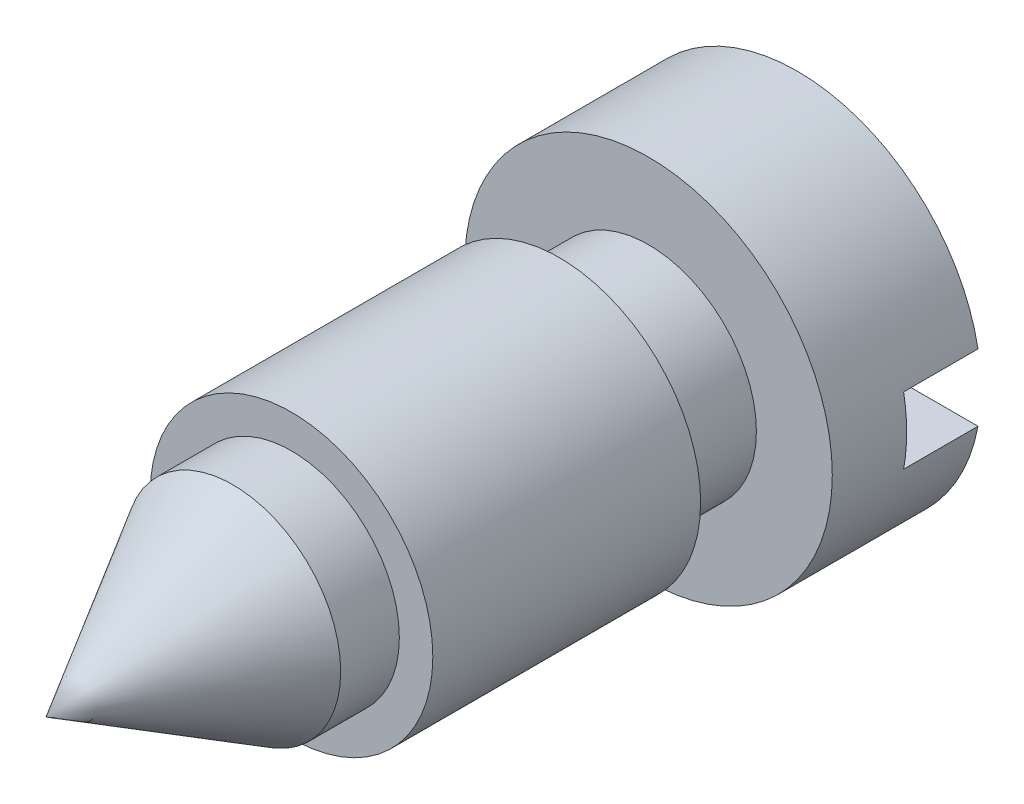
from build123d import *

# Parameters (mm, degrees)
SKETCH_2_W          = 1.27
SKETCH_2_H          = 1.143
CUT_EXTRUDE_1_DEPTH = 3.81


with BuildPart() as part:
    # Sketch 1 → Revolve 1 (revolve)
    with BuildSketch(Plane(origin=(0, 0, 0), x_dir=(0, 0, -1), z_dir=(1, 0, 0)), mode=Mode.PRIVATE) as revolve_1_sk:
        Polygon((0, 0), (0, 3.1369), (-2.54, 3.1369), (-2.54, 1.8415), (-4.064, 1.8415), (-4.064, 2.413), (-8.636, 2.413), (-8.636, 1.8415), (-9.637428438, 1.8415), (-12.827, 0), align=None)
    revolve(revolve_1_sk.sketch.rotate(Axis((0, 0, 50.502286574), (0, 0, -1)), 90), axis=Axis((0, 0, 50.502286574), (0, 0, -1)))

    # Sketch 2 → Cut-Extrude 1 (cut, symmetric)
    with BuildSketch(Plane(origin=(0, 0, 0), x_dir=(0, 0, -1), z_dir=(1, 0, 0))):
        with Locations((-0.635, 0)):
            Rectangle(SKETCH_2_W, SKETCH_2_H)
    extrude(amount=CUT_EXTRUDE_1_DEPTH, both=True, mode=Mode.SUBTRACT)


solid = part.part
